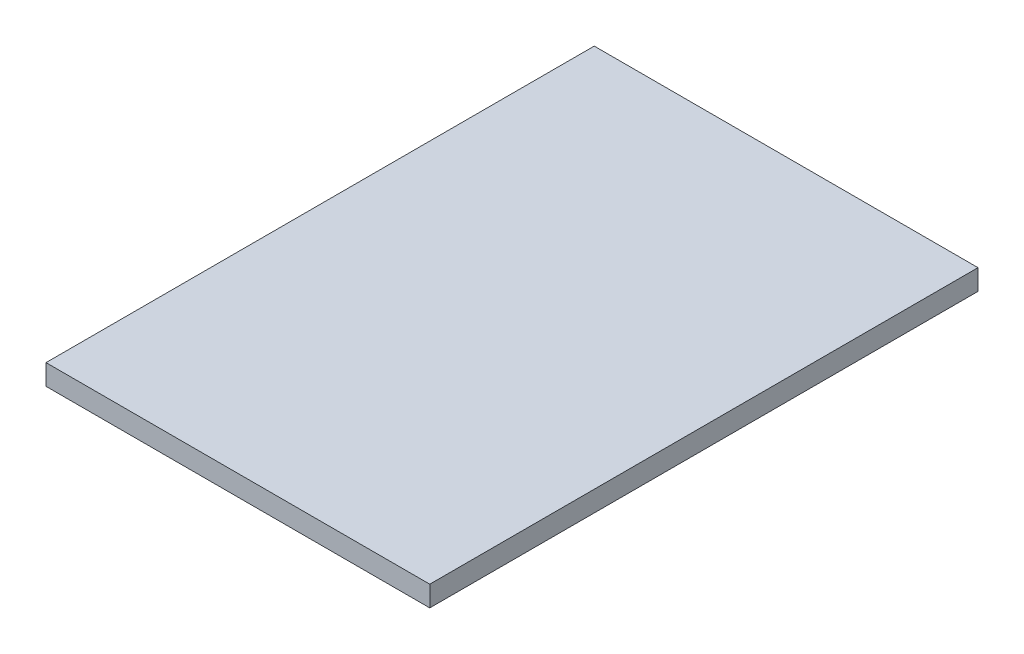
ISO-10303-21;
HEADER;
FILE_DESCRIPTION(('STEP AP214'),'2;1');
FILE_NAME('part.step','',(''),(''),'','','');
FILE_SCHEMA(('AUTOMOTIVE_DESIGN { 1 0 10303 214 1 1 1 1 }'));
ENDSEC;
DATA;
#1=APPLICATION_CONTEXT('core data for automotive mechanical design processes');
#2=APPLICATION_PROTOCOL_DEFINITION('international standard','automotive_design',2000,#1);
#3=PRODUCT_CONTEXT('',#1,'mechanical');
#4=PRODUCT('Part','Part','',(#3));
#5=PRODUCT_RELATED_PRODUCT_CATEGORY('part','',(#4));
#6=PRODUCT_DEFINITION_FORMATION('','',#4);
#7=PRODUCT_DEFINITION_CONTEXT('part definition',#1,'design');
#8=PRODUCT_DEFINITION('design','',#6,#7);
#9=PRODUCT_DEFINITION_SHAPE('','',#8);
#10=(LENGTH_UNIT() NAMED_UNIT(*) SI_UNIT(.MILLI.,.METRE.));
#11=(NAMED_UNIT(*) PLANE_ANGLE_UNIT() SI_UNIT($,.RADIAN.));
#12=(NAMED_UNIT(*) SI_UNIT($,.STERADIAN.) SOLID_ANGLE_UNIT());
#13=UNCERTAINTY_MEASURE_WITH_UNIT(LENGTH_MEASURE(1.E-05),#10,'distance_accuracy_value','');
#14=(GEOMETRIC_REPRESENTATION_CONTEXT(3) GLOBAL_UNCERTAINTY_ASSIGNED_CONTEXT((#13)) GLOBAL_UNIT_ASSIGNED_CONTEXT((#10,
#11,#12)) REPRESENTATION_CONTEXT('',''));
#15=CARTESIAN_POINT('',(0.,0.,0.));
#16=DIRECTION('',(0.,0.,1.));
#17=DIRECTION('',(1.,0.,0.));
#18=AXIS2_PLACEMENT_3D('',#15,#16,#17);
#19=CARTESIAN_POINT('',(-177.8,19.05,0.));
#20=DIRECTION('',(1.,0.,0.));
#21=DIRECTION('',(0.,0.,-1.));
#22=AXIS2_PLACEMENT_3D('',#19,#20,#21);
#23=PLANE('',#22);
#24=DIRECTION('',(0.,0.,1.));
#25=VECTOR('',#24,1.);
#26=CARTESIAN_POINT('',(-177.8,0.,0.));
#27=LINE('',#26,#25);
#28=CARTESIAN_POINT('',(-177.8,0.,-508.));
#29=VERTEX_POINT('',#28);
#30=CARTESIAN_POINT('',(-177.8,0.,0.));
#31=VERTEX_POINT('',#30);
#32=EDGE_CURVE('E97',#29,#31,#27,.T.);
#33=ORIENTED_EDGE('',*,*,#32,.T.);
#34=DIRECTION('',(0.,-1.,0.));
#35=VECTOR('',#34,1.);
#36=CARTESIAN_POINT('',(-177.8,19.05,0.));
#37=LINE('',#36,#35);
#38=CARTESIAN_POINT('',(-177.8,19.05,0.));
#39=VERTEX_POINT('',#38);
#40=EDGE_CURVE('E11',#39,#31,#37,.T.);
#41=ORIENTED_EDGE('',*,*,#40,.F.);
#42=DIRECTION('',(0.,0.,1.));
#43=VECTOR('',#42,1.);
#44=CARTESIAN_POINT('',(-177.8,19.05,0.));
#45=LINE('',#44,#43);
#46=CARTESIAN_POINT('',(-177.8,19.05,-508.));
#47=VERTEX_POINT('',#46);
#48=EDGE_CURVE('E85',#47,#39,#45,.T.);
#49=ORIENTED_EDGE('',*,*,#48,.F.);
#50=DIRECTION('',(0.,-1.,0.));
#51=VECTOR('',#50,1.);
#52=CARTESIAN_POINT('',(-177.8,19.05,-508.));
#53=LINE('',#52,#51);
#54=EDGE_CURVE('E93',#47,#29,#53,.T.);
#55=ORIENTED_EDGE('',*,*,#54,.T.);
#56=EDGE_LOOP('',(#33,#41,#49,#55));
#57=FACE_BOUND('',#56,.T.);
#58=ADVANCED_FACE('F34',(#57),#23,.F.);
#59=CARTESIAN_POINT('',(-177.8,19.05,0.));
#60=DIRECTION('',(0.,0.,-1.));
#61=DIRECTION('',(-1.,0.,0.));
#62=AXIS2_PLACEMENT_3D('',#59,#60,#61);
#63=PLANE('',#62);
#64=DIRECTION('',(1.,0.,0.));
#65=VECTOR('',#64,1.);
#66=CARTESIAN_POINT('',(-177.8,0.,0.));
#67=LINE('',#66,#65);
#68=CARTESIAN_POINT('',(177.8,0.,0.));
#69=VERTEX_POINT('',#68);
#70=EDGE_CURVE('E89',#31,#69,#67,.T.);
#71=ORIENTED_EDGE('',*,*,#70,.T.);
#72=DIRECTION('',(0.,-1.,0.));
#73=VECTOR('',#72,1.);
#74=CARTESIAN_POINT('',(177.8,19.05,0.));
#75=LINE('',#74,#73);
#76=CARTESIAN_POINT('',(177.8,19.05,0.));
#77=VERTEX_POINT('',#76);
#78=EDGE_CURVE('E42',#77,#69,#75,.T.);
#79=ORIENTED_EDGE('',*,*,#78,.F.);
#80=DIRECTION('',(1.,0.,0.));
#81=VECTOR('',#80,1.);
#82=CARTESIAN_POINT('',(-177.8,19.05,0.));
#83=LINE('',#82,#81);
#84=EDGE_CURVE('E80',#39,#77,#83,.T.);
#85=ORIENTED_EDGE('',*,*,#84,.F.);
#86=ORIENTED_EDGE('',*,*,#40,.T.);
#87=EDGE_LOOP('',(#71,#79,#85,#86));
#88=FACE_BOUND('',#87,.T.);
#89=ADVANCED_FACE('F88',(#88),#63,.F.);
#90=CARTESIAN_POINT('',(177.8,19.05,0.));
#91=DIRECTION('',(-1.,0.,0.));
#92=DIRECTION('',(0.,0.,1.));
#93=AXIS2_PLACEMENT_3D('',#90,#91,#92);
#94=PLANE('',#93);
#95=DIRECTION('',(0.,0.,-1.));
#96=VECTOR('',#95,1.);
#97=CARTESIAN_POINT('',(177.8,0.,0.));
#98=LINE('',#97,#96);
#99=CARTESIAN_POINT('',(177.8,0.,-508.));
#100=VERTEX_POINT('',#99);
#101=EDGE_CURVE('E67',#69,#100,#98,.T.);
#102=ORIENTED_EDGE('',*,*,#101,.T.);
#103=DIRECTION('',(0.,-1.,0.));
#104=VECTOR('',#103,1.);
#105=CARTESIAN_POINT('',(177.8,19.05,-508.));
#106=LINE('',#105,#104);
#107=CARTESIAN_POINT('',(177.8,19.05,-508.));
#108=VERTEX_POINT('',#107);
#109=EDGE_CURVE('E90',#108,#100,#106,.T.);
#110=ORIENTED_EDGE('',*,*,#109,.F.);
#111=DIRECTION('',(0.,0.,-1.));
#112=VECTOR('',#111,1.);
#113=CARTESIAN_POINT('',(177.8,19.05,0.));
#114=LINE('',#113,#112);
#115=EDGE_CURVE('E83',#77,#108,#114,.T.);
#116=ORIENTED_EDGE('',*,*,#115,.F.);
#117=ORIENTED_EDGE('',*,*,#78,.T.);
#118=EDGE_LOOP('',(#102,#110,#116,#117));
#119=FACE_BOUND('',#118,.T.);
#120=ADVANCED_FACE('F91',(#119),#94,.F.);
#121=CARTESIAN_POINT('',(-177.8,19.05,-508.));
#122=DIRECTION('',(0.,0.,1.));
#123=DIRECTION('',(1.,0.,0.));
#124=AXIS2_PLACEMENT_3D('',#121,#122,#123);
#125=PLANE('',#124);
#126=DIRECTION('',(-1.,0.,0.));
#127=VECTOR('',#126,1.);
#128=CARTESIAN_POINT('',(-177.8,0.,-508.));
#129=LINE('',#128,#127);
#130=EDGE_CURVE('E73',#100,#29,#129,.T.);
#131=ORIENTED_EDGE('',*,*,#130,.T.);
#132=ORIENTED_EDGE('',*,*,#54,.F.);
#133=DIRECTION('',(-1.,0.,0.));
#134=VECTOR('',#133,1.);
#135=CARTESIAN_POINT('',(-177.8,19.05,-508.));
#136=LINE('',#135,#134);
#137=EDGE_CURVE('E50',#108,#47,#136,.T.);
#138=ORIENTED_EDGE('',*,*,#137,.F.);
#139=ORIENTED_EDGE('',*,*,#109,.T.);
#140=EDGE_LOOP('',(#131,#132,#138,#139));
#141=FACE_BOUND('',#140,.T.);
#142=ADVANCED_FACE('F104',(#141),#125,.F.);
#143=CARTESIAN_POINT('',(0.,19.05,0.));
#144=DIRECTION('',(0.,-1.,0.));
#145=DIRECTION('',(0.,0.,-1.));
#146=AXIS2_PLACEMENT_3D('',#143,#144,#145);
#147=PLANE('',#146);
#148=ORIENTED_EDGE('',*,*,#48,.T.);
#149=ORIENTED_EDGE('',*,*,#84,.T.);
#150=ORIENTED_EDGE('',*,*,#115,.T.);
#151=ORIENTED_EDGE('',*,*,#137,.T.);
#152=EDGE_LOOP('',(#148,#149,#150,#151));
#153=FACE_BOUND('',#152,.T.);
#154=ADVANCED_FACE('F81',(#153),#147,.F.);
#155=CARTESIAN_POINT('',(0.,0.,0.));
#156=DIRECTION('',(0.,-1.,0.));
#157=DIRECTION('',(0.,0.,-1.));
#158=AXIS2_PLACEMENT_3D('',#155,#156,#157);
#159=PLANE('',#158);
#160=ORIENTED_EDGE('',*,*,#32,.F.);
#161=ORIENTED_EDGE('',*,*,#130,.F.);
#162=ORIENTED_EDGE('',*,*,#101,.F.);
#163=ORIENTED_EDGE('',*,*,#70,.F.);
#164=EDGE_LOOP('',(#160,#161,#162,#163));
#165=FACE_BOUND('',#164,.T.);
#166=ADVANCED_FACE('F107',(#165),#159,.T.);
#167=CLOSED_SHELL('',(#58,#89,#120,#142,#154,#166));
#168=MANIFOLD_SOLID_BREP('B2',#167);
#169=ADVANCED_BREP_SHAPE_REPRESENTATION('',(#18,#168),#14);
#170=SHAPE_DEFINITION_REPRESENTATION(#9,#169);
ENDSEC;
END-ISO-10303-21;
